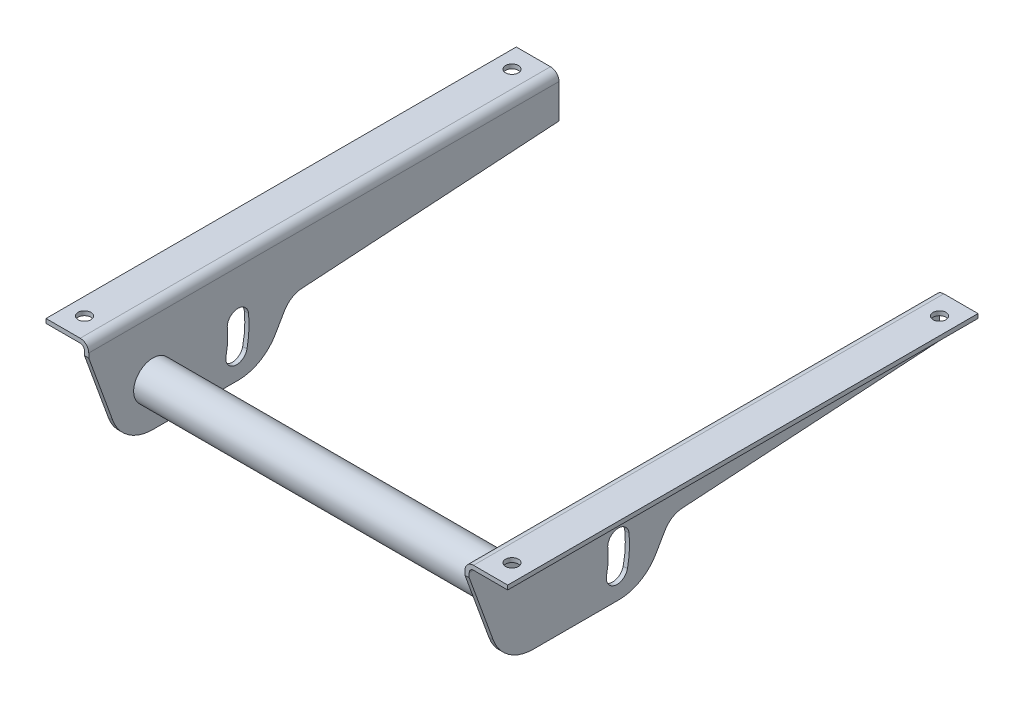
ISO-10303-21;
HEADER;
FILE_DESCRIPTION(('STEP AP214'),'2;1');
FILE_NAME('part.step','',(''),(''),'','','');
FILE_SCHEMA(('AUTOMOTIVE_DESIGN { 1 0 10303 214 1 1 1 1 }'));
ENDSEC;
DATA;
#1=APPLICATION_CONTEXT('core data for automotive mechanical design processes');
#2=APPLICATION_PROTOCOL_DEFINITION('international standard','automotive_design',2000,#1);
#3=PRODUCT_CONTEXT('',#1,'mechanical');
#4=PRODUCT('Part','Part','',(#3));
#5=PRODUCT_RELATED_PRODUCT_CATEGORY('part','',(#4));
#6=PRODUCT_DEFINITION_FORMATION('','',#4);
#7=PRODUCT_DEFINITION_CONTEXT('part definition',#1,'design');
#8=PRODUCT_DEFINITION('design','',#6,#7);
#9=PRODUCT_DEFINITION_SHAPE('','',#8);
#10=(LENGTH_UNIT() NAMED_UNIT(*) SI_UNIT(.MILLI.,.METRE.));
#11=(NAMED_UNIT(*) PLANE_ANGLE_UNIT() SI_UNIT($,.RADIAN.));
#12=(NAMED_UNIT(*) SI_UNIT($,.STERADIAN.) SOLID_ANGLE_UNIT());
#13=UNCERTAINTY_MEASURE_WITH_UNIT(LENGTH_MEASURE(1.E-05),#10,'distance_accuracy_value','');
#14=(GEOMETRIC_REPRESENTATION_CONTEXT(3) GLOBAL_UNCERTAINTY_ASSIGNED_CONTEXT((#13)) GLOBAL_UNIT_ASSIGNED_CONTEXT((#10,
#11,#12)) REPRESENTATION_CONTEXT('',''));
#15=CARTESIAN_POINT('',(0.,0.,0.));
#16=DIRECTION('',(0.,0.,1.));
#17=DIRECTION('',(1.,0.,0.));
#18=AXIS2_PLACEMENT_3D('',#15,#16,#17);
#19=CARTESIAN_POINT('',(-88.,-4.,-30.));
#20=DIRECTION('',(-1.,0.,0.));
#21=DIRECTION('',(0.,0.,1.));
#22=AXIS2_PLACEMENT_3D('',#19,#20,#21);
#23=PLANE('',#22);
#24=DIRECTION('',(0.,0.,1.));
#25=VECTOR('',#24,1.);
#26=CARTESIAN_POINT('',(-88.,-50.,-30.));
#27=LINE('',#26,#25);
#28=CARTESIAN_POINT('',(-88.,-50.,120.));
#29=VERTEX_POINT('',#28);
#30=CARTESIAN_POINT('',(-88.,-50.,160.));
#31=VERTEX_POINT('',#30);
#32=EDGE_CURVE('E574',#29,#31,#27,.T.);
#33=ORIENTED_EDGE('',*,*,#32,.F.);
#34=CARTESIAN_POINT('',(-88.,-30.,120.));
#35=DIRECTION('',(-1.,0.,0.));
#36=DIRECTION('',(0.,0.,1.));
#37=AXIS2_PLACEMENT_3D('',#34,#35,#36);
#38=CIRCLE('',#37,20.);
#39=CARTESIAN_POINT('',(-88.,-40.0000000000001,102.679491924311));
#40=VERTEX_POINT('',#39);
#41=EDGE_CURVE('E440',#29,#40,#38,.F.);
#42=ORIENTED_EDGE('',*,*,#41,.T.);
#43=DIRECTION('',(0.,0.866025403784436,-0.500000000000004));
#44=VECTOR('',#43,1.);
#45=CARTESIAN_POINT('',(-88.,44.4519052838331,53.9211616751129));
#46=LINE('',#45,#44);
#47=CARTESIAN_POINT('',(-88.,-32.6396847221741,98.4300119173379));
#48=VERTEX_POINT('',#47);
#49=EDGE_CURVE('E57',#40,#48,#46,.T.);
#50=ORIENTED_EDGE('',*,*,#49,.T.);
#51=CARTESIAN_POINT('',(-88.,-37.6396847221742,89.7697578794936));
#52=DIRECTION('',(-1.,0.,0.));
#53=DIRECTION('',(0.,0.,1.));
#54=AXIS2_PLACEMENT_3D('',#51,#52,#53);
#55=CIRCLE('',#54,9.99999999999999);
#56=CARTESIAN_POINT('',(-88.,-27.6598595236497,90.4046507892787));
#57=VERTEX_POINT('',#56);
#58=EDGE_CURVE('E600',#48,#57,#55,.T.);
#59=ORIENTED_EDGE('',*,*,#58,.T.);
#60=DIRECTION('',(0.,0.0634892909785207,-0.997982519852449));
#61=VECTOR('',#60,1.);
#62=CARTESIAN_POINT('',(-88.,-19.9355057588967,-31.0137792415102));
#63=LINE('',#62,#61);
#64=CARTESIAN_POINT('',(-88.,-20.,-30.));
#65=VERTEX_POINT('',#64);
#66=EDGE_CURVE('E423',#57,#65,#63,.T.);
#67=ORIENTED_EDGE('',*,*,#66,.T.);
#68=DIRECTION('',(0.,1.,0.));
#69=VECTOR('',#68,1.);
#70=CARTESIAN_POINT('',(-88.,-4.,-30.));
#71=LINE('',#70,#69);
#72=CARTESIAN_POINT('',(-88.,-4.,-30.));
#73=VERTEX_POINT('',#72);
#74=EDGE_CURVE('E533',#73,#65,#71,.F.);
#75=ORIENTED_EDGE('',*,*,#74,.F.);
#76=DIRECTION('',(0.,0.,1.));
#77=VECTOR('',#76,1.);
#78=CARTESIAN_POINT('',(-88.,-4.,-30.));
#79=LINE('',#78,#77);
#80=CARTESIAN_POINT('',(-88.,-4.,190.));
#81=VERTEX_POINT('',#80);
#82=EDGE_CURVE('E571',#73,#81,#79,.T.);
#83=ORIENTED_EDGE('',*,*,#82,.T.);
#84=DIRECTION('',(0.,1.,0.));
#85=VECTOR('',#84,1.);
#86=CARTESIAN_POINT('',(-88.,-4.,190.));
#87=LINE('',#86,#85);
#88=CARTESIAN_POINT('',(-88.,-6.05176541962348,190.));
#89=VERTEX_POINT('',#88);
#90=EDGE_CURVE('E505',#81,#89,#87,.F.);
#91=ORIENTED_EDGE('',*,*,#90,.T.);
#92=DIRECTION('',(0.,-0.939692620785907,-0.342020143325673));
#93=VECTOR('',#92,1.);
#94=CARTESIAN_POINT('',(-88.,-74.9466480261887,164.924313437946));
#95=LINE('',#94,#93);
#96=CARTESIAN_POINT('',(-88.,-36.8404028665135,178.793852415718));
#97=VERTEX_POINT('',#96);
#98=EDGE_CURVE('E483',#89,#97,#95,.T.);
#99=ORIENTED_EDGE('',*,*,#98,.T.);
#100=CARTESIAN_POINT('',(-88.,-30.,160.));
#101=DIRECTION('',(-1.,0.,0.));
#102=DIRECTION('',(0.,0.,1.));
#103=AXIS2_PLACEMENT_3D('',#100,#101,#102);
#104=CIRCLE('',#103,20.);
#105=EDGE_CURVE('E493',#97,#31,#104,.F.);
#106=ORIENTED_EDGE('',*,*,#105,.T.);
#107=EDGE_LOOP('',(#33,#42,#50,#59,#67,#75,#83,#91,#99,#106));
#108=FACE_BOUND('',#107,.T.);
#109=CARTESIAN_POINT('',(-88.,-30.,160.));
#110=DIRECTION('',(-1.,0.,0.));
#111=DIRECTION('',(0.,0.,1.));
#112=AXIS2_PLACEMENT_3D('',#109,#110,#111);
#113=CIRCLE('',#112,45.);
#114=CARTESIAN_POINT('',(-88.,-25.2962191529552,115.246514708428));
#115=VERTEX_POINT('',#114);
#116=CARTESIAN_POINT('',(-88.,-39.3560260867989,115.983357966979));
#117=VERTEX_POINT('',#116);
#118=EDGE_CURVE('E581',#115,#117,#113,.T.);
#119=ORIENTED_EDGE('',*,*,#118,.T.);
#120=CARTESIAN_POINT('',(-88.,-38.3164676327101,120.874095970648));
#121=DIRECTION('',(-1.,0.,0.));
#122=DIRECTION('',(0.,0.,1.));
#123=AXIS2_PLACEMENT_3D('',#120,#121,#122);
#124=CIRCLE('',#123,4.99999999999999);
#125=CARTESIAN_POINT('',(-88.,-37.2769091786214,125.764833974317));
#126=VERTEX_POINT('',#125);
#127=EDGE_CURVE('E593',#117,#126,#124,.T.);
#128=ORIENTED_EDGE('',*,*,#127,.T.);
#129=CARTESIAN_POINT('',(-88.,-30.,160.));
#130=DIRECTION('',(-1.,0.,0.));
#131=DIRECTION('',(0.,0.,1.));
#132=AXIS2_PLACEMENT_3D('',#129,#130,#131);
#133=CIRCLE('',#132,35.);
#134=CARTESIAN_POINT('',(-88.,-26.3415037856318,125.19173366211));
#135=VERTEX_POINT('',#134);
#136=EDGE_CURVE('E589',#126,#135,#133,.F.);
#137=ORIENTED_EDGE('',*,*,#136,.T.);
#138=CARTESIAN_POINT('',(-88.,-25.8188614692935,120.219124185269));
#139=DIRECTION('',(-1.,0.,0.));
#140=DIRECTION('',(0.,0.,1.));
#141=AXIS2_PLACEMENT_3D('',#138,#139,#140);
#142=CIRCLE('',#141,4.99999999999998);
#143=EDGE_CURVE('E585',#135,#115,#142,.T.);
#144=ORIENTED_EDGE('',*,*,#143,.T.);
#145=EDGE_LOOP('',(#119,#128,#137,#144));
#146=FACE_BOUND('',#145,.T.);
#147=CARTESIAN_POINT('',(-88.,-30.,160.));
#148=DIRECTION('',(-1.,0.,0.));
#149=DIRECTION('',(0.,0.,1.));
#150=AXIS2_PLACEMENT_3D('',#147,#148,#149);
#151=CIRCLE('',#150,9.00000000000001);
#152=CARTESIAN_POINT('',(-88.,-30.,169.));
#153=VERTEX_POINT('',#152);
#154=EDGE_CURVE('E11',#153,#153,#151,.F.);
#155=ORIENTED_EDGE('',*,*,#154,.F.);
#156=EDGE_LOOP('',(#155));
#157=FACE_BOUND('',#156,.T.);
#158=ADVANCED_FACE('F47',(#108,#146,#157),#23,.F.);
#159=CARTESIAN_POINT('',(-88.,-50.,-30.));
#160=DIRECTION('',(0.,1.,0.));
#161=DIRECTION('',(0.,0.,1.));
#162=AXIS2_PLACEMENT_3D('',#159,#160,#161);
#163=PLANE('',#162);
#164=DIRECTION('',(1.,0.,0.));
#165=VECTOR('',#164,1.);
#166=CARTESIAN_POINT('',(-108.,-50.,120.));
#167=LINE('',#166,#165);
#168=CARTESIAN_POINT('',(-90.,-50.,120.));
#169=VERTEX_POINT('',#168);
#170=EDGE_CURVE('E419',#169,#29,#167,.T.);
#171=ORIENTED_EDGE('',*,*,#170,.T.);
#172=ORIENTED_EDGE('',*,*,#32,.T.);
#173=DIRECTION('',(1.,0.,0.));
#174=VECTOR('',#173,1.);
#175=CARTESIAN_POINT('',(-108.,-50.,160.));
#176=LINE('',#175,#174);
#177=CARTESIAN_POINT('',(-90.,-50.,160.));
#178=VERTEX_POINT('',#177);
#179=EDGE_CURVE('E479',#178,#31,#176,.T.);
#180=ORIENTED_EDGE('',*,*,#179,.F.);
#181=DIRECTION('',(0.,0.,1.));
#182=VECTOR('',#181,1.);
#183=CARTESIAN_POINT('',(-90.,-50.,-30.));
#184=LINE('',#183,#182);
#185=EDGE_CURVE('E554',#169,#178,#184,.T.);
#186=ORIENTED_EDGE('',*,*,#185,.F.);
#187=EDGE_LOOP('',(#171,#172,#180,#186));
#188=FACE_BOUND('',#187,.T.);
#189=ADVANCED_FACE('F625',(#188),#163,.F.);
#190=CARTESIAN_POINT('',(-90.,-4.,-30.));
#191=DIRECTION('',(-1.,0.,0.));
#192=DIRECTION('',(0.,0.,1.));
#193=AXIS2_PLACEMENT_3D('',#190,#191,#192);
#194=PLANE('',#193);
#195=CARTESIAN_POINT('',(-90.,-30.,120.));
#196=DIRECTION('',(-1.,0.,0.));
#197=DIRECTION('',(0.,0.,1.));
#198=AXIS2_PLACEMENT_3D('',#195,#196,#197);
#199=CIRCLE('',#198,20.);
#200=CARTESIAN_POINT('',(-90.,-40.0000000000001,102.679491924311));
#201=VERTEX_POINT('',#200);
#202=EDGE_CURVE('E444',#169,#201,#199,.F.);
#203=ORIENTED_EDGE('',*,*,#202,.F.);
#204=ORIENTED_EDGE('',*,*,#185,.T.);
#205=CARTESIAN_POINT('',(-90.,-30.,160.));
#206=DIRECTION('',(-1.,0.,0.));
#207=DIRECTION('',(0.,0.,1.));
#208=AXIS2_PLACEMENT_3D('',#205,#206,#207);
#209=CIRCLE('',#208,20.);
#210=CARTESIAN_POINT('',(-90.,-36.8404028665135,178.793852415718));
#211=VERTEX_POINT('',#210);
#212=EDGE_CURVE('E497',#211,#178,#209,.F.);
#213=ORIENTED_EDGE('',*,*,#212,.F.);
#214=DIRECTION('',(0.,-0.939692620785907,-0.342020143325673));
#215=VECTOR('',#214,1.);
#216=CARTESIAN_POINT('',(-90.,-74.9466480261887,164.924313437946));
#217=LINE('',#216,#215);
#218=CARTESIAN_POINT('',(-90.,-6.05176541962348,190.));
#219=VERTEX_POINT('',#218);
#220=EDGE_CURVE('E490',#219,#211,#217,.T.);
#221=ORIENTED_EDGE('',*,*,#220,.F.);
#222=DIRECTION('',(0.,-1.,0.));
#223=VECTOR('',#222,1.);
#224=CARTESIAN_POINT('',(-90.,-4.,190.));
#225=LINE('',#224,#223);
#226=CARTESIAN_POINT('',(-90.,-4.,190.));
#227=VERTEX_POINT('',#226);
#228=EDGE_CURVE('E501',#227,#219,#225,.T.);
#229=ORIENTED_EDGE('',*,*,#228,.F.);
#230=DIRECTION('',(0.,0.,1.));
#231=VECTOR('',#230,1.);
#232=CARTESIAN_POINT('',(-90.,-4.,-30.));
#233=LINE('',#232,#231);
#234=CARTESIAN_POINT('',(-90.,-4.,-30.));
#235=VERTEX_POINT('',#234);
#236=EDGE_CURVE('E555',#235,#227,#233,.T.);
#237=ORIENTED_EDGE('',*,*,#236,.F.);
#238=DIRECTION('',(0.,-1.,0.));
#239=VECTOR('',#238,1.);
#240=CARTESIAN_POINT('',(-90.,-4.,-30.));
#241=LINE('',#240,#239);
#242=CARTESIAN_POINT('',(-90.,-20.,-30.));
#243=VERTEX_POINT('',#242);
#244=EDGE_CURVE('E529',#235,#243,#241,.T.);
#245=ORIENTED_EDGE('',*,*,#244,.T.);
#246=DIRECTION('',(0.,0.0634892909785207,-0.997982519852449));
#247=VECTOR('',#246,1.);
#248=CARTESIAN_POINT('',(-90.,-19.9355057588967,-31.0137792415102));
#249=LINE('',#248,#247);
#250=CARTESIAN_POINT('',(-90.,-27.6598595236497,90.4046507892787));
#251=VERTEX_POINT('',#250);
#252=EDGE_CURVE('E64',#251,#243,#249,.T.);
#253=ORIENTED_EDGE('',*,*,#252,.F.);
#254=CARTESIAN_POINT('',(-90.,-37.6396847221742,89.7697578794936));
#255=DIRECTION('',(-1.,0.,0.));
#256=DIRECTION('',(0.,0.,1.));
#257=AXIS2_PLACEMENT_3D('',#254,#255,#256);
#258=CIRCLE('',#257,9.99999999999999);
#259=CARTESIAN_POINT('',(-90.,-32.6396847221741,98.4300119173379));
#260=VERTEX_POINT('',#259);
#261=EDGE_CURVE('E447',#260,#251,#258,.T.);
#262=ORIENTED_EDGE('',*,*,#261,.F.);
#263=DIRECTION('',(0.,0.866025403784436,-0.500000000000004));
#264=VECTOR('',#263,1.);
#265=CARTESIAN_POINT('',(-90.,44.4519052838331,53.9211616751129));
#266=LINE('',#265,#264);
#267=EDGE_CURVE('E450',#201,#260,#266,.T.);
#268=ORIENTED_EDGE('',*,*,#267,.F.);
#269=EDGE_LOOP('',(#203,#204,#213,#221,#229,#237,#245,#253,#262,#268));
#270=FACE_BOUND('',#269,.T.);
#271=CARTESIAN_POINT('',(-90.,-38.3164676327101,120.874095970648));
#272=DIRECTION('',(-1.,0.,0.));
#273=DIRECTION('',(0.,0.,1.));
#274=AXIS2_PLACEMENT_3D('',#271,#272,#273);
#275=CIRCLE('',#274,4.99999999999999);
#276=CARTESIAN_POINT('',(-90.,-39.3560260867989,115.983357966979));
#277=VERTEX_POINT('',#276);
#278=CARTESIAN_POINT('',(-90.,-37.2769091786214,125.764833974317));
#279=VERTEX_POINT('',#278);
#280=EDGE_CURVE('E475',#277,#279,#275,.T.);
#281=ORIENTED_EDGE('',*,*,#280,.F.);
#282=CARTESIAN_POINT('',(-90.,-30.,160.));
#283=DIRECTION('',(-1.,0.,0.));
#284=DIRECTION('',(0.,0.,1.));
#285=AXIS2_PLACEMENT_3D('',#282,#283,#284);
#286=CIRCLE('',#285,45.);
#287=CARTESIAN_POINT('',(-90.,-25.2962191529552,115.246514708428));
#288=VERTEX_POINT('',#287);
#289=EDGE_CURVE('E458',#288,#277,#286,.T.);
#290=ORIENTED_EDGE('',*,*,#289,.F.);
#291=CARTESIAN_POINT('',(-90.,-25.8188614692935,120.219124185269));
#292=DIRECTION('',(-1.,0.,0.));
#293=DIRECTION('',(0.,0.,1.));
#294=AXIS2_PLACEMENT_3D('',#291,#292,#293);
#295=CIRCLE('',#294,4.99999999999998);
#296=CARTESIAN_POINT('',(-90.,-26.3415037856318,125.19173366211));
#297=VERTEX_POINT('',#296);
#298=EDGE_CURVE('E469',#297,#288,#295,.T.);
#299=ORIENTED_EDGE('',*,*,#298,.F.);
#300=CARTESIAN_POINT('',(-90.,-30.,160.));
#301=DIRECTION('',(-1.,0.,0.));
#302=DIRECTION('',(0.,0.,1.));
#303=AXIS2_PLACEMENT_3D('',#300,#301,#302);
#304=CIRCLE('',#303,35.);
#305=EDGE_CURVE('E472',#279,#297,#304,.F.);
#306=ORIENTED_EDGE('',*,*,#305,.F.);
#307=EDGE_LOOP('',(#281,#290,#299,#306));
#308=FACE_BOUND('',#307,.T.);
#309=ADVANCED_FACE('F49',(#270,#308),#194,.T.);
#310=CARTESIAN_POINT('',(-92.,-4.,-30.));
#311=DIRECTION('',(0.,0.,1.));
#312=DIRECTION('',(1.,0.,0.));
#313=AXIS2_PLACEMENT_3D('',#310,#311,#312);
#314=CYLINDRICAL_SURFACE('',#313,2.);
#315=ORIENTED_EDGE('',*,*,#236,.T.);
#316=CARTESIAN_POINT('',(-92.,-4.,190.));
#317=DIRECTION('',(0.,0.,-1.));
#318=DIRECTION('',(-1.,0.,0.));
#319=AXIS2_PLACEMENT_3D('',#316,#317,#318);
#320=CIRCLE('',#319,2.);
#321=CARTESIAN_POINT('',(-92.,-2.,190.));
#322=VERTEX_POINT('',#321);
#323=EDGE_CURVE('E525',#322,#227,#320,.T.);
#324=ORIENTED_EDGE('',*,*,#323,.F.);
#325=DIRECTION('',(0.,0.,1.));
#326=VECTOR('',#325,1.);
#327=CARTESIAN_POINT('',(-92.,-2.,-30.));
#328=LINE('',#327,#326);
#329=CARTESIAN_POINT('',(-92.,-2.,-30.));
#330=VERTEX_POINT('',#329);
#331=EDGE_CURVE('E559',#330,#322,#328,.T.);
#332=ORIENTED_EDGE('',*,*,#331,.F.);
#333=CARTESIAN_POINT('',(-92.,-4.,-30.));
#334=DIRECTION('',(0.,0.,-1.));
#335=DIRECTION('',(-1.,0.,0.));
#336=AXIS2_PLACEMENT_3D('',#333,#334,#335);
#337=CIRCLE('',#336,2.);
#338=EDGE_CURVE('E550',#330,#235,#337,.T.);
#339=ORIENTED_EDGE('',*,*,#338,.T.);
#340=EDGE_LOOP('',(#315,#324,#332,#339));
#341=FACE_BOUND('',#340,.T.);
#342=ADVANCED_FACE('F645',(#341),#314,.F.);
#343=CARTESIAN_POINT('',(-108.,-2.,-30.));
#344=DIRECTION('',(0.,-1.,0.));
#345=DIRECTION('',(1.,0.,0.));
#346=AXIS2_PLACEMENT_3D('',#343,#344,#345);
#347=PLANE('',#346);
#348=CARTESIAN_POINT('',(-100.,-2.,-20.));
#349=DIRECTION('',(0.,-1.,0.));
#350=DIRECTION('',(1.,0.,0.));
#351=AXIS2_PLACEMENT_3D('',#348,#349,#350);
#352=CIRCLE('',#351,3.00000000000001);
#353=CARTESIAN_POINT('',(-97.,-2.,-20.));
#354=VERTEX_POINT('',#353);
#355=EDGE_CURVE('E406',#354,#354,#352,.T.);
#356=ORIENTED_EDGE('',*,*,#355,.F.);
#357=EDGE_LOOP('',(#356));
#358=FACE_BOUND('',#357,.T.);
#359=CARTESIAN_POINT('',(-100.,-2.,180.));
#360=DIRECTION('',(0.,-1.,0.));
#361=DIRECTION('',(1.,0.,0.));
#362=AXIS2_PLACEMENT_3D('',#359,#360,#361);
#363=CIRCLE('',#362,3.00000000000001);
#364=CARTESIAN_POINT('',(-97.,-2.,180.));
#365=VERTEX_POINT('',#364);
#366=EDGE_CURVE('E414',#365,#365,#363,.T.);
#367=ORIENTED_EDGE('',*,*,#366,.F.);
#368=EDGE_LOOP('',(#367));
#369=FACE_BOUND('',#368,.T.);
#370=ORIENTED_EDGE('',*,*,#331,.T.);
#371=DIRECTION('',(1.,0.,0.));
#372=VECTOR('',#371,1.);
#373=CARTESIAN_POINT('',(-108.,-2.,190.));
#374=LINE('',#373,#372);
#375=CARTESIAN_POINT('',(-108.,-2.,190.));
#376=VERTEX_POINT('',#375);
#377=EDGE_CURVE('E521',#376,#322,#374,.T.);
#378=ORIENTED_EDGE('',*,*,#377,.F.);
#379=DIRECTION('',(0.,0.,1.));
#380=VECTOR('',#379,1.);
#381=CARTESIAN_POINT('',(-108.,-2.,-30.));
#382=LINE('',#381,#380);
#383=CARTESIAN_POINT('',(-108.,-2.,-30.));
#384=VERTEX_POINT('',#383);
#385=EDGE_CURVE('E562',#384,#376,#382,.T.);
#386=ORIENTED_EDGE('',*,*,#385,.F.);
#387=DIRECTION('',(1.,0.,0.));
#388=VECTOR('',#387,1.);
#389=CARTESIAN_POINT('',(-108.,-2.,-30.));
#390=LINE('',#389,#388);
#391=EDGE_CURVE('E546',#384,#330,#390,.T.);
#392=ORIENTED_EDGE('',*,*,#391,.T.);
#393=EDGE_LOOP('',(#370,#378,#386,#392));
#394=FACE_BOUND('',#393,.T.);
#395=ADVANCED_FACE('F648',(#358,#369,#394),#347,.T.);
#396=CARTESIAN_POINT('',(-108.,-2.,-30.));
#397=DIRECTION('',(1.,0.,0.));
#398=DIRECTION('',(0.,0.,-1.));
#399=AXIS2_PLACEMENT_3D('',#396,#397,#398);
#400=PLANE('',#399);
#401=ORIENTED_EDGE('',*,*,#385,.T.);
#402=DIRECTION('',(0.,1.,0.));
#403=VECTOR('',#402,1.);
#404=CARTESIAN_POINT('',(-108.,-2.,190.));
#405=LINE('',#404,#403);
#406=CARTESIAN_POINT('',(-108.,0.,190.));
#407=VERTEX_POINT('',#406);
#408=EDGE_CURVE('E517',#376,#407,#405,.T.);
#409=ORIENTED_EDGE('',*,*,#408,.T.);
#410=DIRECTION('',(0.,0.,1.));
#411=VECTOR('',#410,1.);
#412=CARTESIAN_POINT('',(-108.,0.,-30.));
#413=LINE('',#412,#411);
#414=CARTESIAN_POINT('',(-108.,0.,-30.));
#415=VERTEX_POINT('',#414);
#416=EDGE_CURVE('E565',#415,#407,#413,.T.);
#417=ORIENTED_EDGE('',*,*,#416,.F.);
#418=DIRECTION('',(0.,1.,0.));
#419=VECTOR('',#418,1.);
#420=CARTESIAN_POINT('',(-108.,-2.,-30.));
#421=LINE('',#420,#419);
#422=EDGE_CURVE('E543',#384,#415,#421,.T.);
#423=ORIENTED_EDGE('',*,*,#422,.F.);
#424=EDGE_LOOP('',(#401,#409,#417,#423));
#425=FACE_BOUND('',#424,.T.);
#426=ADVANCED_FACE('F654',(#425),#400,.F.);
#427=CARTESIAN_POINT('',(-108.,0.,-30.));
#428=DIRECTION('',(0.,-1.,0.));
#429=DIRECTION('',(1.,0.,0.));
#430=AXIS2_PLACEMENT_3D('',#427,#428,#429);
#431=PLANE('',#430);
#432=CARTESIAN_POINT('',(-100.,0.,-20.));
#433=DIRECTION('',(0.,1.,0.));
#434=DIRECTION('',(0.,0.,1.));
#435=AXIS2_PLACEMENT_3D('',#432,#433,#434);
#436=CIRCLE('',#435,3.00000000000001);
#437=CARTESIAN_POINT('',(-100.,0.,-17.));
#438=VERTEX_POINT('',#437);
#439=EDGE_CURVE('E402',#438,#438,#436,.T.);
#440=ORIENTED_EDGE('',*,*,#439,.F.);
#441=EDGE_LOOP('',(#440));
#442=FACE_BOUND('',#441,.T.);
#443=CARTESIAN_POINT('',(-100.,0.,180.));
#444=DIRECTION('',(0.,1.,0.));
#445=DIRECTION('',(0.,0.,1.));
#446=AXIS2_PLACEMENT_3D('',#443,#444,#445);
#447=CIRCLE('',#446,3.00000000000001);
#448=CARTESIAN_POINT('',(-100.,0.,183.));
#449=VERTEX_POINT('',#448);
#450=EDGE_CURVE('E410',#449,#449,#447,.T.);
#451=ORIENTED_EDGE('',*,*,#450,.F.);
#452=EDGE_LOOP('',(#451));
#453=FACE_BOUND('',#452,.T.);
#454=ORIENTED_EDGE('',*,*,#416,.T.);
#455=DIRECTION('',(1.,0.,0.));
#456=VECTOR('',#455,1.);
#457=CARTESIAN_POINT('',(-108.,0.,190.));
#458=LINE('',#457,#456);
#459=CARTESIAN_POINT('',(-92.,0.,190.));
#460=VERTEX_POINT('',#459);
#461=EDGE_CURVE('E513',#407,#460,#458,.T.);
#462=ORIENTED_EDGE('',*,*,#461,.T.);
#463=DIRECTION('',(0.,0.,1.));
#464=VECTOR('',#463,1.);
#465=CARTESIAN_POINT('',(-92.,0.,-30.));
#466=LINE('',#465,#464);
#467=CARTESIAN_POINT('',(-92.,0.,-30.));
#468=VERTEX_POINT('',#467);
#469=EDGE_CURVE('E568',#468,#460,#466,.T.);
#470=ORIENTED_EDGE('',*,*,#469,.F.);
#471=DIRECTION('',(1.,0.,0.));
#472=VECTOR('',#471,1.);
#473=CARTESIAN_POINT('',(-108.,0.,-30.));
#474=LINE('',#473,#472);
#475=EDGE_CURVE('E540',#415,#468,#474,.T.);
#476=ORIENTED_EDGE('',*,*,#475,.F.);
#477=EDGE_LOOP('',(#454,#462,#470,#476));
#478=FACE_BOUND('',#477,.T.);
#479=ADVANCED_FACE('F658',(#442,#453,#478),#431,.F.);
#480=CARTESIAN_POINT('',(-92.,-4.,-30.));
#481=DIRECTION('',(0.,0.,1.));
#482=DIRECTION('',(1.,0.,0.));
#483=AXIS2_PLACEMENT_3D('',#480,#481,#482);
#484=CYLINDRICAL_SURFACE('',#483,4.);
#485=ORIENTED_EDGE('',*,*,#469,.T.);
#486=CARTESIAN_POINT('',(-92.,-4.,190.));
#487=DIRECTION('',(0.,0.,1.));
#488=DIRECTION('',(1.,0.,0.));
#489=AXIS2_PLACEMENT_3D('',#486,#487,#488);
#490=CIRCLE('',#489,4.);
#491=EDGE_CURVE('E509',#460,#81,#490,.F.);
#492=ORIENTED_EDGE('',*,*,#491,.T.);
#493=ORIENTED_EDGE('',*,*,#82,.F.);
#494=CARTESIAN_POINT('',(-92.,-4.,-30.));
#495=DIRECTION('',(0.,0.,1.));
#496=DIRECTION('',(1.,0.,0.));
#497=AXIS2_PLACEMENT_3D('',#494,#495,#496);
#498=CIRCLE('',#497,4.);
#499=EDGE_CURVE('E537',#468,#73,#498,.F.);
#500=ORIENTED_EDGE('',*,*,#499,.F.);
#501=EDGE_LOOP('',(#485,#492,#493,#500));
#502=FACE_BOUND('',#501,.T.);
#503=ADVANCED_FACE('F662',(#502),#484,.T.);
#504=CARTESIAN_POINT('',(-92.,-4.,-30.));
#505=DIRECTION('',(0.,0.,1.));
#506=DIRECTION('',(1.,0.,0.));
#507=AXIS2_PLACEMENT_3D('',#504,#505,#506);
#508=PLANE('',#507);
#509=ORIENTED_EDGE('',*,*,#74,.T.);
#510=DIRECTION('',(-1.,0.,0.));
#511=VECTOR('',#510,1.);
#512=CARTESIAN_POINT('',(-92.,-20.,-30.));
#513=LINE('',#512,#511);
#514=EDGE_CURVE('E597',#65,#243,#513,.T.);
#515=ORIENTED_EDGE('',*,*,#514,.T.);
#516=ORIENTED_EDGE('',*,*,#244,.F.);
#517=ORIENTED_EDGE('',*,*,#338,.F.);
#518=ORIENTED_EDGE('',*,*,#391,.F.);
#519=ORIENTED_EDGE('',*,*,#422,.T.);
#520=ORIENTED_EDGE('',*,*,#475,.T.);
#521=ORIENTED_EDGE('',*,*,#499,.T.);
#522=EDGE_LOOP('',(#509,#515,#516,#517,#518,#519,#520,#521));
#523=FACE_BOUND('',#522,.T.);
#524=ADVANCED_FACE('F643',(#523),#508,.F.);
#525=CARTESIAN_POINT('',(-92.,-4.,190.));
#526=DIRECTION('',(0.,0.,1.));
#527=DIRECTION('',(1.,0.,0.));
#528=AXIS2_PLACEMENT_3D('',#525,#526,#527);
#529=PLANE('',#528);
#530=DIRECTION('',(-1.,0.,0.));
#531=VECTOR('',#530,1.);
#532=CARTESIAN_POINT('',(-92.,-6.05176541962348,190.));
#533=LINE('',#532,#531);
#534=EDGE_CURVE('E558',#89,#219,#533,.T.);
#535=ORIENTED_EDGE('',*,*,#534,.F.);
#536=ORIENTED_EDGE('',*,*,#90,.F.);
#537=ORIENTED_EDGE('',*,*,#491,.F.);
#538=ORIENTED_EDGE('',*,*,#461,.F.);
#539=ORIENTED_EDGE('',*,*,#408,.F.);
#540=ORIENTED_EDGE('',*,*,#377,.T.);
#541=ORIENTED_EDGE('',*,*,#323,.T.);
#542=ORIENTED_EDGE('',*,*,#228,.T.);
#543=EDGE_LOOP('',(#535,#536,#537,#538,#539,#540,#541,#542));
#544=FACE_BOUND('',#543,.T.);
#545=ADVANCED_FACE('F635',(#544),#529,.T.);
#546=CARTESIAN_POINT('',(-108.,-30.,160.));
#547=DIRECTION('',(1.,0.,0.));
#548=DIRECTION('',(0.,0.,-1.));
#549=AXIS2_PLACEMENT_3D('',#546,#547,#548);
#550=CYLINDRICAL_SURFACE('',#549,20.);
#551=ORIENTED_EDGE('',*,*,#212,.T.);
#552=ORIENTED_EDGE('',*,*,#179,.T.);
#553=ORIENTED_EDGE('',*,*,#105,.F.);
#554=DIRECTION('',(1.,0.,0.));
#555=VECTOR('',#554,1.);
#556=CARTESIAN_POINT('',(-108.,-36.8404028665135,178.793852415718));
#557=LINE('',#556,#555);
#558=EDGE_CURVE('E478',#211,#97,#557,.T.);
#559=ORIENTED_EDGE('',*,*,#558,.F.);
#560=EDGE_LOOP('',(#551,#552,#553,#559));
#561=FACE_BOUND('',#560,.T.);
#562=ADVANCED_FACE('F627',(#561),#550,.T.);
#563=CARTESIAN_POINT('',(-108.,-36.8404028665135,178.793852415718));
#564=DIRECTION('',(0.,0.342020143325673,-0.939692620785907));
#565=DIRECTION('',(0.,0.939692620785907,0.342020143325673));
#566=AXIS2_PLACEMENT_3D('',#563,#564,#565);
#567=PLANE('',#566);
#568=ORIENTED_EDGE('',*,*,#220,.T.);
#569=ORIENTED_EDGE('',*,*,#558,.T.);
#570=ORIENTED_EDGE('',*,*,#98,.F.);
#571=ORIENTED_EDGE('',*,*,#534,.T.);
#572=EDGE_LOOP('',(#568,#569,#570,#571));
#573=FACE_BOUND('',#572,.T.);
#574=ADVANCED_FACE('F632',(#573),#567,.F.);
#575=CARTESIAN_POINT('',(-108.,-38.3164676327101,120.874095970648));
#576=DIRECTION('',(1.,0.,0.));
#577=DIRECTION('',(0.,0.,-1.));
#578=AXIS2_PLACEMENT_3D('',#575,#576,#577);
#579=CYLINDRICAL_SURFACE('',#578,4.99999999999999);
#580=ORIENTED_EDGE('',*,*,#280,.T.);
#581=DIRECTION('',(1.,0.,0.));
#582=VECTOR('',#581,1.);
#583=CARTESIAN_POINT('',(-108.,-37.2769091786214,125.764833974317));
#584=LINE('',#583,#582);
#585=EDGE_CURVE('E454',#279,#126,#584,.T.);
#586=ORIENTED_EDGE('',*,*,#585,.T.);
#587=ORIENTED_EDGE('',*,*,#127,.F.);
#588=DIRECTION('',(1.,0.,0.));
#589=VECTOR('',#588,1.);
#590=CARTESIAN_POINT('',(-108.,-39.3560260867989,115.983357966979));
#591=LINE('',#590,#589);
#592=EDGE_CURVE('E453',#277,#117,#591,.T.);
#593=ORIENTED_EDGE('',*,*,#592,.F.);
#594=EDGE_LOOP('',(#580,#586,#587,#593));
#595=FACE_BOUND('',#594,.T.);
#596=ADVANCED_FACE('F937',(#595),#579,.F.);
#597=CARTESIAN_POINT('',(-108.,-30.,160.));
#598=DIRECTION('',(1.,0.,0.));
#599=DIRECTION('',(0.,0.,-1.));
#600=AXIS2_PLACEMENT_3D('',#597,#598,#599);
#601=CYLINDRICAL_SURFACE('',#600,35.);
#602=ORIENTED_EDGE('',*,*,#305,.T.);
#603=DIRECTION('',(1.,0.,0.));
#604=VECTOR('',#603,1.);
#605=CARTESIAN_POINT('',(-108.,-26.3415037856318,125.19173366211));
#606=LINE('',#605,#604);
#607=EDGE_CURVE('E459',#297,#135,#606,.T.);
#608=ORIENTED_EDGE('',*,*,#607,.T.);
#609=ORIENTED_EDGE('',*,*,#136,.F.);
#610=ORIENTED_EDGE('',*,*,#585,.F.);
#611=EDGE_LOOP('',(#602,#608,#609,#610));
#612=FACE_BOUND('',#611,.T.);
#613=ADVANCED_FACE('F940',(#612),#601,.T.);
#614=CARTESIAN_POINT('',(-108.,-25.8188614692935,120.219124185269));
#615=DIRECTION('',(1.,0.,0.));
#616=DIRECTION('',(0.,0.,-1.));
#617=AXIS2_PLACEMENT_3D('',#614,#615,#616);
#618=CYLINDRICAL_SURFACE('',#617,4.99999999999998);
#619=ORIENTED_EDGE('',*,*,#298,.T.);
#620=DIRECTION('',(1.,0.,0.));
#621=VECTOR('',#620,1.);
#622=CARTESIAN_POINT('',(-108.,-25.2962191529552,115.246514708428));
#623=LINE('',#622,#621);
#624=EDGE_CURVE('E72',#288,#115,#623,.T.);
#625=ORIENTED_EDGE('',*,*,#624,.T.);
#626=ORIENTED_EDGE('',*,*,#143,.F.);
#627=ORIENTED_EDGE('',*,*,#607,.F.);
#628=EDGE_LOOP('',(#619,#625,#626,#627));
#629=FACE_BOUND('',#628,.T.);
#630=ADVANCED_FACE('F944',(#629),#618,.F.);
#631=CARTESIAN_POINT('',(-108.,-30.,160.));
#632=DIRECTION('',(1.,0.,0.));
#633=DIRECTION('',(0.,0.,-1.));
#634=AXIS2_PLACEMENT_3D('',#631,#632,#633);
#635=CYLINDRICAL_SURFACE('',#634,45.);
#636=ORIENTED_EDGE('',*,*,#289,.T.);
#637=ORIENTED_EDGE('',*,*,#592,.T.);
#638=ORIENTED_EDGE('',*,*,#118,.F.);
#639=ORIENTED_EDGE('',*,*,#624,.F.);
#640=EDGE_LOOP('',(#636,#637,#638,#639));
#641=FACE_BOUND('',#640,.T.);
#642=ADVANCED_FACE('F674',(#641),#635,.F.);
#643=CARTESIAN_POINT('',(-108.,-40.0000000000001,102.679491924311));
#644=DIRECTION('',(0.,0.500000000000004,0.866025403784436));
#645=DIRECTION('',(0.,-0.866025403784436,0.500000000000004));
#646=AXIS2_PLACEMENT_3D('',#643,#644,#645);
#647=PLANE('',#646);
#648=ORIENTED_EDGE('',*,*,#267,.T.);
#649=DIRECTION('',(1.,0.,0.));
#650=VECTOR('',#649,1.);
#651=CARTESIAN_POINT('',(-108.,-32.6396847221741,98.4300119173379));
#652=LINE('',#651,#650);
#653=EDGE_CURVE('E428',#260,#48,#652,.T.);
#654=ORIENTED_EDGE('',*,*,#653,.T.);
#655=ORIENTED_EDGE('',*,*,#49,.F.);
#656=DIRECTION('',(1.,0.,0.));
#657=VECTOR('',#656,1.);
#658=CARTESIAN_POINT('',(-108.,-40.0000000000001,102.679491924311));
#659=LINE('',#658,#657);
#660=EDGE_CURVE('E424',#201,#40,#659,.T.);
#661=ORIENTED_EDGE('',*,*,#660,.F.);
#662=EDGE_LOOP('',(#648,#654,#655,#661));
#663=FACE_BOUND('',#662,.T.);
#664=ADVANCED_FACE('F612',(#663),#647,.F.);
#665=CARTESIAN_POINT('',(-108.,-37.6396847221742,89.7697578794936));
#666=DIRECTION('',(1.,0.,0.));
#667=DIRECTION('',(0.,0.,-1.));
#668=AXIS2_PLACEMENT_3D('',#665,#666,#667);
#669=CYLINDRICAL_SURFACE('',#668,9.99999999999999);
#670=ORIENTED_EDGE('',*,*,#261,.T.);
#671=DIRECTION('',(1.,0.,0.));
#672=VECTOR('',#671,1.);
#673=CARTESIAN_POINT('',(-108.,-27.6598595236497,90.4046507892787));
#674=LINE('',#673,#672);
#675=EDGE_CURVE('E418',#251,#57,#674,.T.);
#676=ORIENTED_EDGE('',*,*,#675,.T.);
#677=ORIENTED_EDGE('',*,*,#58,.F.);
#678=ORIENTED_EDGE('',*,*,#653,.F.);
#679=EDGE_LOOP('',(#670,#676,#677,#678));
#680=FACE_BOUND('',#679,.T.);
#681=ADVANCED_FACE('F666',(#680),#669,.F.);
#682=CARTESIAN_POINT('',(-108.,-30.,120.));
#683=DIRECTION('',(1.,0.,0.));
#684=DIRECTION('',(0.,0.,-1.));
#685=AXIS2_PLACEMENT_3D('',#682,#683,#684);
#686=CYLINDRICAL_SURFACE('',#685,20.);
#687=ORIENTED_EDGE('',*,*,#202,.T.);
#688=ORIENTED_EDGE('',*,*,#660,.T.);
#689=ORIENTED_EDGE('',*,*,#41,.F.);
#690=ORIENTED_EDGE('',*,*,#170,.F.);
#691=EDGE_LOOP('',(#687,#688,#689,#690));
#692=FACE_BOUND('',#691,.T.);
#693=ADVANCED_FACE('F616',(#692),#686,.T.);
#694=CARTESIAN_POINT('',(-108.,-20.,-30.));
#695=DIRECTION('',(0.,0.997982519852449,0.0634892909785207));
#696=DIRECTION('',(0.,-0.0634892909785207,0.997982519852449));
#697=AXIS2_PLACEMENT_3D('',#694,#695,#696);
#698=PLANE('',#697);
#699=ORIENTED_EDGE('',*,*,#252,.T.);
#700=ORIENTED_EDGE('',*,*,#514,.F.);
#701=ORIENTED_EDGE('',*,*,#66,.F.);
#702=ORIENTED_EDGE('',*,*,#675,.F.);
#703=EDGE_LOOP('',(#699,#700,#701,#702));
#704=FACE_BOUND('',#703,.T.);
#705=ADVANCED_FACE('F664',(#704),#698,.F.);
#706=CARTESIAN_POINT('',(-100.,-50.,180.));
#707=DIRECTION('',(0.,1.,0.));
#708=DIRECTION('',(0.,0.,1.));
#709=AXIS2_PLACEMENT_3D('',#706,#707,#708);
#710=CYLINDRICAL_SURFACE('',#709,3.00000000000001);
#711=ORIENTED_EDGE('',*,*,#366,.T.);
#712=EDGE_LOOP('',(#711));
#713=FACE_BOUND('',#712,.T.);
#714=ORIENTED_EDGE('',*,*,#450,.T.);
#715=EDGE_LOOP('',(#714));
#716=FACE_BOUND('',#715,.T.);
#717=ADVANCED_FACE('F903',(#713,#716),#710,.F.);
#718=CARTESIAN_POINT('',(-100.,-50.,-20.));
#719=DIRECTION('',(0.,1.,0.));
#720=DIRECTION('',(0.,0.,1.));
#721=AXIS2_PLACEMENT_3D('',#718,#719,#720);
#722=CYLINDRICAL_SURFACE('',#721,3.00000000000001);
#723=ORIENTED_EDGE('',*,*,#355,.T.);
#724=EDGE_LOOP('',(#723));
#725=FACE_BOUND('',#724,.T.);
#726=ORIENTED_EDGE('',*,*,#439,.T.);
#727=EDGE_LOOP('',(#726));
#728=FACE_BOUND('',#727,.T.);
#729=ADVANCED_FACE('F899',(#725,#728),#722,.F.);
#730=CARTESIAN_POINT('',(25.4558441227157,-30.,160.));
#731=DIRECTION('',(-1.,0.,0.));
#732=DIRECTION('',(0.,0.,1.));
#733=AXIS2_PLACEMENT_3D('',#730,#731,#732);
#734=CYLINDRICAL_SURFACE('',#733,9.00000000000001);
#735=ORIENTED_EDGE('',*,*,#154,.T.);
#736=EDGE_LOOP('',(#735));
#737=FACE_BOUND('',#736,.T.);
#738=CARTESIAN_POINT('',(88.,-30.,160.));
#739=DIRECTION('',(-1.,0.,0.));
#740=DIRECTION('',(0.,0.,1.));
#741=AXIS2_PLACEMENT_3D('',#738,#739,#740);
#742=CIRCLE('',#741,9.00000000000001);
#743=CARTESIAN_POINT('',(88.,-30.,169.));
#744=VERTEX_POINT('',#743);
#745=EDGE_CURVE('E394',#744,#744,#742,.F.);
#746=ORIENTED_EDGE('',*,*,#745,.F.);
#747=EDGE_LOOP('',(#746));
#748=FACE_BOUND('',#747,.T.);
#749=ADVANCED_FACE('F895',(#737,#748),#734,.T.);
#750=CARTESIAN_POINT('',(100.,-50.,-20.));
#751=DIRECTION('',(0.,1.,0.));
#752=DIRECTION('',(0.,0.,1.));
#753=AXIS2_PLACEMENT_3D('',#750,#751,#752);
#754=CYLINDRICAL_SURFACE('',#753,3.00000000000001);
#755=CARTESIAN_POINT('',(100.,-2.,-20.));
#756=DIRECTION('',(0.,1.,0.));
#757=DIRECTION('',(-1.,0.,0.));
#758=AXIS2_PLACEMENT_3D('',#755,#756,#757);
#759=CIRCLE('',#758,3.00000000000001);
#760=CARTESIAN_POINT('',(97.,-2.,-20.));
#761=VERTEX_POINT('',#760);
#762=EDGE_CURVE('E708',#761,#761,#759,.T.);
#763=ORIENTED_EDGE('',*,*,#762,.F.);
#764=EDGE_LOOP('',(#763));
#765=FACE_BOUND('',#764,.T.);
#766=CARTESIAN_POINT('',(100.,0.,-20.));
#767=DIRECTION('',(0.,-1.,0.));
#768=DIRECTION('',(0.,0.,1.));
#769=AXIS2_PLACEMENT_3D('',#766,#767,#768);
#770=CIRCLE('',#769,3.00000000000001);
#771=CARTESIAN_POINT('',(100.,0.,-17.));
#772=VERTEX_POINT('',#771);
#773=EDGE_CURVE('E702',#772,#772,#770,.T.);
#774=ORIENTED_EDGE('',*,*,#773,.F.);
#775=EDGE_LOOP('',(#774));
#776=FACE_BOUND('',#775,.T.);
#777=ADVANCED_FACE('F898',(#765,#776),#754,.F.);
#778=CARTESIAN_POINT('',(100.,-50.,180.));
#779=DIRECTION('',(0.,1.,0.));
#780=DIRECTION('',(0.,0.,1.));
#781=AXIS2_PLACEMENT_3D('',#778,#779,#780);
#782=CYLINDRICAL_SURFACE('',#781,3.00000000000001);
#783=CARTESIAN_POINT('',(100.,-2.,180.));
#784=DIRECTION('',(0.,1.,0.));
#785=DIRECTION('',(-1.,0.,0.));
#786=AXIS2_PLACEMENT_3D('',#783,#784,#785);
#787=CIRCLE('',#786,3.00000000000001);
#788=CARTESIAN_POINT('',(97.,-2.,180.));
#789=VERTEX_POINT('',#788);
#790=EDGE_CURVE('E718',#789,#789,#787,.T.);
#791=ORIENTED_EDGE('',*,*,#790,.F.);
#792=EDGE_LOOP('',(#791));
#793=FACE_BOUND('',#792,.T.);
#794=CARTESIAN_POINT('',(100.,0.,180.));
#795=DIRECTION('',(0.,-1.,0.));
#796=DIRECTION('',(0.,0.,1.));
#797=AXIS2_PLACEMENT_3D('',#794,#795,#796);
#798=CIRCLE('',#797,3.00000000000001);
#799=CARTESIAN_POINT('',(100.,0.,183.));
#800=VERTEX_POINT('',#799);
#801=EDGE_CURVE('E714',#800,#800,#798,.T.);
#802=ORIENTED_EDGE('',*,*,#801,.F.);
#803=EDGE_LOOP('',(#802));
#804=FACE_BOUND('',#803,.T.);
#805=ADVANCED_FACE('F1089',(#793,#804),#782,.F.);
#806=CARTESIAN_POINT('',(108.,-20.,-30.));
#807=DIRECTION('',(0.,0.997982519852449,0.0634892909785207));
#808=DIRECTION('',(0.,-0.0634892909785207,0.997982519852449));
#809=AXIS2_PLACEMENT_3D('',#806,#807,#808);
#810=PLANE('',#809);
#811=DIRECTION('',(0.,0.0634892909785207,-0.997982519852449));
#812=VECTOR('',#811,1.);
#813=CARTESIAN_POINT('',(90.,-19.9355057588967,-31.0137792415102));
#814=LINE('',#813,#812);
#815=CARTESIAN_POINT('',(90.,-27.6598595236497,90.4046507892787));
#816=VERTEX_POINT('',#815);
#817=CARTESIAN_POINT('',(90.,-20.,-30.));
#818=VERTEX_POINT('',#817);
#819=EDGE_CURVE('E306',#816,#818,#814,.T.);
#820=ORIENTED_EDGE('',*,*,#819,.F.);
#821=DIRECTION('',(-1.,0.,0.));
#822=VECTOR('',#821,1.);
#823=CARTESIAN_POINT('',(108.,-27.6598595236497,90.4046507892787));
#824=LINE('',#823,#822);
#825=CARTESIAN_POINT('',(88.,-27.6598595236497,90.4046507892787));
#826=VERTEX_POINT('',#825);
#827=EDGE_CURVE('E301',#816,#826,#824,.T.);
#828=ORIENTED_EDGE('',*,*,#827,.T.);
#829=DIRECTION('',(0.,0.0634892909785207,-0.997982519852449));
#830=VECTOR('',#829,1.);
#831=CARTESIAN_POINT('',(88.,-19.9355057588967,-31.0137792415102));
#832=LINE('',#831,#830);
#833=CARTESIAN_POINT('',(88.,-20.,-30.));
#834=VERTEX_POINT('',#833);
#835=EDGE_CURVE('E299',#826,#834,#832,.T.);
#836=ORIENTED_EDGE('',*,*,#835,.T.);
#837=DIRECTION('',(1.,0.,0.));
#838=VECTOR('',#837,1.);
#839=CARTESIAN_POINT('',(92.,-20.,-30.));
#840=LINE('',#839,#838);
#841=EDGE_CURVE('E283',#834,#818,#840,.T.);
#842=ORIENTED_EDGE('',*,*,#841,.T.);
#843=EDGE_LOOP('',(#820,#828,#836,#842));
#844=FACE_BOUND('',#843,.T.);
#845=ADVANCED_FACE('F300',(#844),#810,.F.);
#846=CARTESIAN_POINT('',(108.,-30.,120.));
#847=DIRECTION('',(-1.,0.,0.));
#848=DIRECTION('',(0.,0.,-1.));
#849=AXIS2_PLACEMENT_3D('',#846,#847,#848);
#850=CYLINDRICAL_SURFACE('',#849,20.);
#851=CARTESIAN_POINT('',(90.,-30.,120.));
#852=DIRECTION('',(-1.,0.,0.));
#853=DIRECTION('',(0.,0.,1.));
#854=AXIS2_PLACEMENT_3D('',#851,#852,#853);
#855=CIRCLE('',#854,20.);
#856=CARTESIAN_POINT('',(90.,-50.,120.));
#857=VERTEX_POINT('',#856);
#858=CARTESIAN_POINT('',(90.,-40.0000000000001,102.679491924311));
#859=VERTEX_POINT('',#858);
#860=EDGE_CURVE('E738',#857,#859,#855,.F.);
#861=ORIENTED_EDGE('',*,*,#860,.F.);
#862=DIRECTION('',(-1.,0.,0.));
#863=VECTOR('',#862,1.);
#864=CARTESIAN_POINT('',(108.,-50.,120.));
#865=LINE('',#864,#863);
#866=CARTESIAN_POINT('',(88.,-50.,120.));
#867=VERTEX_POINT('',#866);
#868=EDGE_CURVE('E307',#857,#867,#865,.T.);
#869=ORIENTED_EDGE('',*,*,#868,.T.);
#870=CARTESIAN_POINT('',(88.,-30.,120.));
#871=DIRECTION('',(-1.,0.,0.));
#872=DIRECTION('',(0.,0.,1.));
#873=AXIS2_PLACEMENT_3D('',#870,#871,#872);
#874=CIRCLE('',#873,20.);
#875=CARTESIAN_POINT('',(88.,-40.0000000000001,102.679491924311));
#876=VERTEX_POINT('',#875);
#877=EDGE_CURVE('E734',#867,#876,#874,.F.);
#878=ORIENTED_EDGE('',*,*,#877,.T.);
#879=DIRECTION('',(-1.,0.,0.));
#880=VECTOR('',#879,1.);
#881=CARTESIAN_POINT('',(108.,-40.0000000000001,102.679491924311));
#882=LINE('',#881,#880);
#883=EDGE_CURVE('E724',#859,#876,#882,.T.);
#884=ORIENTED_EDGE('',*,*,#883,.F.);
#885=EDGE_LOOP('',(#861,#869,#878,#884));
#886=FACE_BOUND('',#885,.T.);
#887=ADVANCED_FACE('F847',(#886),#850,.T.);
#888=CARTESIAN_POINT('',(108.,-37.6396847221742,89.7697578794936));
#889=DIRECTION('',(-1.,0.,0.));
#890=DIRECTION('',(0.,0.,-1.));
#891=AXIS2_PLACEMENT_3D('',#888,#889,#890);
#892=CYLINDRICAL_SURFACE('',#891,9.99999999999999);
#893=CARTESIAN_POINT('',(90.,-37.6396847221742,89.7697578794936));
#894=DIRECTION('',(-1.,0.,0.));
#895=DIRECTION('',(0.,0.,1.));
#896=AXIS2_PLACEMENT_3D('',#893,#894,#895);
#897=CIRCLE('',#896,9.99999999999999);
#898=CARTESIAN_POINT('',(90.,-32.6396847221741,98.4300119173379));
#899=VERTEX_POINT('',#898);
#900=EDGE_CURVE('E742',#899,#816,#897,.T.);
#901=ORIENTED_EDGE('',*,*,#900,.F.);
#902=DIRECTION('',(-1.,0.,0.));
#903=VECTOR('',#902,1.);
#904=CARTESIAN_POINT('',(108.,-32.6396847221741,98.4300119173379));
#905=LINE('',#904,#903);
#906=CARTESIAN_POINT('',(88.,-32.6396847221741,98.4300119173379));
#907=VERTEX_POINT('',#906);
#908=EDGE_CURVE('E727',#899,#907,#905,.T.);
#909=ORIENTED_EDGE('',*,*,#908,.T.);
#910=CARTESIAN_POINT('',(88.,-37.6396847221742,89.7697578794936));
#911=DIRECTION('',(-1.,0.,0.));
#912=DIRECTION('',(0.,0.,1.));
#913=AXIS2_PLACEMENT_3D('',#910,#911,#912);
#914=CIRCLE('',#913,9.99999999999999);
#915=EDGE_CURVE('E295',#907,#826,#914,.T.);
#916=ORIENTED_EDGE('',*,*,#915,.T.);
#917=ORIENTED_EDGE('',*,*,#827,.F.);
#918=EDGE_LOOP('',(#901,#909,#916,#917));
#919=FACE_BOUND('',#918,.T.);
#920=ADVANCED_FACE('F840',(#919),#892,.F.);
#921=CARTESIAN_POINT('',(108.,-40.0000000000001,102.679491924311));
#922=DIRECTION('',(0.,0.500000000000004,0.866025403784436));
#923=DIRECTION('',(0.,-0.866025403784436,0.500000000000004));
#924=AXIS2_PLACEMENT_3D('',#921,#922,#923);
#925=PLANE('',#924);
#926=DIRECTION('',(0.,0.866025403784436,-0.500000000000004));
#927=VECTOR('',#926,1.);
#928=CARTESIAN_POINT('',(90.,44.4519052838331,53.9211616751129));
#929=LINE('',#928,#927);
#930=EDGE_CURVE('E746',#859,#899,#929,.T.);
#931=ORIENTED_EDGE('',*,*,#930,.F.);
#932=ORIENTED_EDGE('',*,*,#883,.T.);
#933=DIRECTION('',(0.,0.866025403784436,-0.500000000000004));
#934=VECTOR('',#933,1.);
#935=CARTESIAN_POINT('',(88.,44.4519052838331,53.9211616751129));
#936=LINE('',#935,#934);
#937=EDGE_CURVE('E390',#876,#907,#936,.T.);
#938=ORIENTED_EDGE('',*,*,#937,.T.);
#939=ORIENTED_EDGE('',*,*,#908,.F.);
#940=EDGE_LOOP('',(#931,#932,#938,#939));
#941=FACE_BOUND('',#940,.T.);
#942=ADVANCED_FACE('F845',(#941),#925,.F.);
#943=CARTESIAN_POINT('',(108.,-30.,160.));
#944=DIRECTION('',(-1.,0.,0.));
#945=DIRECTION('',(0.,0.,-1.));
#946=AXIS2_PLACEMENT_3D('',#943,#944,#945);
#947=CYLINDRICAL_SURFACE('',#946,45.);
#948=CARTESIAN_POINT('',(90.,-30.,160.));
#949=DIRECTION('',(-1.,0.,0.));
#950=DIRECTION('',(0.,0.,1.));
#951=AXIS2_PLACEMENT_3D('',#948,#949,#950);
#952=CIRCLE('',#951,45.);
#953=CARTESIAN_POINT('',(90.,-25.2962191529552,115.246514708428));
#954=VERTEX_POINT('',#953);
#955=CARTESIAN_POINT('',(90.,-39.3560260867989,115.983357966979));
#956=VERTEX_POINT('',#955);
#957=EDGE_CURVE('E754',#954,#956,#952,.T.);
#958=ORIENTED_EDGE('',*,*,#957,.F.);
#959=DIRECTION('',(-1.,0.,0.));
#960=VECTOR('',#959,1.);
#961=CARTESIAN_POINT('',(108.,-25.2962191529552,115.246514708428));
#962=LINE('',#961,#960);
#963=CARTESIAN_POINT('',(88.,-25.2962191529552,115.246514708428));
#964=VERTEX_POINT('',#963);
#965=EDGE_CURVE('E758',#954,#964,#962,.T.);
#966=ORIENTED_EDGE('',*,*,#965,.T.);
#967=CARTESIAN_POINT('',(88.,-30.,160.));
#968=DIRECTION('',(-1.,0.,0.));
#969=DIRECTION('',(0.,0.,1.));
#970=AXIS2_PLACEMENT_3D('',#967,#968,#969);
#971=CIRCLE('',#970,45.);
#972=CARTESIAN_POINT('',(88.,-39.3560260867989,115.983357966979));
#973=VERTEX_POINT('',#972);
#974=EDGE_CURVE('E373',#964,#973,#971,.T.);
#975=ORIENTED_EDGE('',*,*,#974,.T.);
#976=DIRECTION('',(-1.,0.,0.));
#977=VECTOR('',#976,1.);
#978=CARTESIAN_POINT('',(108.,-39.3560260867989,115.983357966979));
#979=LINE('',#978,#977);
#980=EDGE_CURVE('E750',#956,#973,#979,.T.);
#981=ORIENTED_EDGE('',*,*,#980,.F.);
#982=EDGE_LOOP('',(#958,#966,#975,#981));
#983=FACE_BOUND('',#982,.T.);
#984=ADVANCED_FACE('F1051',(#983),#947,.F.);
#985=CARTESIAN_POINT('',(108.,-25.8188614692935,120.219124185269));
#986=DIRECTION('',(-1.,0.,0.));
#987=DIRECTION('',(0.,0.,-1.));
#988=AXIS2_PLACEMENT_3D('',#985,#986,#987);
#989=CYLINDRICAL_SURFACE('',#988,4.99999999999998);
#990=CARTESIAN_POINT('',(90.,-25.8188614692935,120.219124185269));
#991=DIRECTION('',(-1.,0.,0.));
#992=DIRECTION('',(0.,0.,1.));
#993=AXIS2_PLACEMENT_3D('',#990,#991,#992);
#994=CIRCLE('',#993,4.99999999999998);
#995=CARTESIAN_POINT('',(90.,-26.3415037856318,125.19173366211));
#996=VERTEX_POINT('',#995);
#997=EDGE_CURVE('E766',#996,#954,#994,.T.);
#998=ORIENTED_EDGE('',*,*,#997,.F.);
#999=DIRECTION('',(-1.,0.,0.));
#1000=VECTOR('',#999,1.);
#1001=CARTESIAN_POINT('',(108.,-26.3415037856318,125.19173366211));
#1002=LINE('',#1001,#1000);
#1003=CARTESIAN_POINT('',(88.,-26.3415037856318,125.19173366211));
#1004=VERTEX_POINT('',#1003);
#1005=EDGE_CURVE('E755',#996,#1004,#1002,.T.);
#1006=ORIENTED_EDGE('',*,*,#1005,.T.);
#1007=CARTESIAN_POINT('',(88.,-25.8188614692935,120.219124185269));
#1008=DIRECTION('',(-1.,0.,0.));
#1009=DIRECTION('',(0.,0.,1.));
#1010=AXIS2_PLACEMENT_3D('',#1007,#1008,#1009);
#1011=CIRCLE('',#1010,4.99999999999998);
#1012=EDGE_CURVE('E377',#1004,#964,#1011,.T.);
#1013=ORIENTED_EDGE('',*,*,#1012,.T.);
#1014=ORIENTED_EDGE('',*,*,#965,.F.);
#1015=EDGE_LOOP('',(#998,#1006,#1013,#1014));
#1016=FACE_BOUND('',#1015,.T.);
#1017=ADVANCED_FACE('F1042',(#1016),#989,.F.);
#1018=CARTESIAN_POINT('',(108.,-30.,160.));
#1019=DIRECTION('',(-1.,0.,0.));
#1020=DIRECTION('',(0.,0.,-1.));
#1021=AXIS2_PLACEMENT_3D('',#1018,#1019,#1020);
#1022=CYLINDRICAL_SURFACE('',#1021,35.);
#1023=CARTESIAN_POINT('',(90.,-30.,160.));
#1024=DIRECTION('',(-1.,0.,0.));
#1025=DIRECTION('',(0.,0.,1.));
#1026=AXIS2_PLACEMENT_3D('',#1023,#1024,#1025);
#1027=CIRCLE('',#1026,35.);
#1028=CARTESIAN_POINT('',(90.,-37.2769091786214,125.764833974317));
#1029=VERTEX_POINT('',#1028);
#1030=EDGE_CURVE('E770',#1029,#996,#1027,.F.);
#1031=ORIENTED_EDGE('',*,*,#1030,.F.);
#1032=DIRECTION('',(-1.,0.,0.));
#1033=VECTOR('',#1032,1.);
#1034=CARTESIAN_POINT('',(108.,-37.2769091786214,125.764833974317));
#1035=LINE('',#1034,#1033);
#1036=CARTESIAN_POINT('',(88.,-37.2769091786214,125.764833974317));
#1037=VERTEX_POINT('',#1036);
#1038=EDGE_CURVE('E751',#1029,#1037,#1035,.T.);
#1039=ORIENTED_EDGE('',*,*,#1038,.T.);
#1040=CARTESIAN_POINT('',(88.,-30.,160.));
#1041=DIRECTION('',(-1.,0.,0.));
#1042=DIRECTION('',(0.,0.,1.));
#1043=AXIS2_PLACEMENT_3D('',#1040,#1041,#1042);
#1044=CIRCLE('',#1043,35.);
#1045=EDGE_CURVE('E381',#1037,#1004,#1044,.F.);
#1046=ORIENTED_EDGE('',*,*,#1045,.T.);
#1047=ORIENTED_EDGE('',*,*,#1005,.F.);
#1048=EDGE_LOOP('',(#1031,#1039,#1046,#1047));
#1049=FACE_BOUND('',#1048,.T.);
#1050=ADVANCED_FACE('F1033',(#1049),#1022,.T.);
#1051=CARTESIAN_POINT('',(108.,-38.3164676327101,120.874095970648));
#1052=DIRECTION('',(-1.,0.,0.));
#1053=DIRECTION('',(0.,0.,-1.));
#1054=AXIS2_PLACEMENT_3D('',#1051,#1052,#1053);
#1055=CYLINDRICAL_SURFACE('',#1054,4.99999999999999);
#1056=CARTESIAN_POINT('',(90.,-38.3164676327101,120.874095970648));
#1057=DIRECTION('',(-1.,0.,0.));
#1058=DIRECTION('',(0.,0.,1.));
#1059=AXIS2_PLACEMENT_3D('',#1056,#1057,#1058);
#1060=CIRCLE('',#1059,4.99999999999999);
#1061=EDGE_CURVE('E774',#956,#1029,#1060,.T.);
#1062=ORIENTED_EDGE('',*,*,#1061,.F.);
#1063=ORIENTED_EDGE('',*,*,#980,.T.);
#1064=CARTESIAN_POINT('',(88.,-38.3164676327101,120.874095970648));
#1065=DIRECTION('',(-1.,0.,0.));
#1066=DIRECTION('',(0.,0.,1.));
#1067=AXIS2_PLACEMENT_3D('',#1064,#1065,#1066);
#1068=CIRCLE('',#1067,4.99999999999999);
#1069=EDGE_CURVE('E296',#973,#1037,#1068,.T.);
#1070=ORIENTED_EDGE('',*,*,#1069,.T.);
#1071=ORIENTED_EDGE('',*,*,#1038,.F.);
#1072=EDGE_LOOP('',(#1062,#1063,#1070,#1071));
#1073=FACE_BOUND('',#1072,.T.);
#1074=ADVANCED_FACE('F1025',(#1073),#1055,.F.);
#1075=CARTESIAN_POINT('',(108.,-36.8404028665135,178.793852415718));
#1076=DIRECTION('',(0.,0.342020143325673,-0.939692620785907));
#1077=DIRECTION('',(0.,0.939692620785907,0.342020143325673));
#1078=AXIS2_PLACEMENT_3D('',#1075,#1076,#1077);
#1079=PLANE('',#1078);
#1080=DIRECTION('',(0.,-0.939692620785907,-0.342020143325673));
#1081=VECTOR('',#1080,1.);
#1082=CARTESIAN_POINT('',(90.,-74.9466480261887,164.924313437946));
#1083=LINE('',#1082,#1081);
#1084=CARTESIAN_POINT('',(90.,-6.05176541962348,190.));
#1085=VERTEX_POINT('',#1084);
#1086=CARTESIAN_POINT('',(90.,-36.8404028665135,178.793852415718));
#1087=VERTEX_POINT('',#1086);
#1088=EDGE_CURVE('E788',#1085,#1087,#1083,.T.);
#1089=ORIENTED_EDGE('',*,*,#1088,.F.);
#1090=DIRECTION('',(1.,0.,0.));
#1091=VECTOR('',#1090,1.);
#1092=CARTESIAN_POINT('',(92.,-6.05176541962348,190.));
#1093=LINE('',#1092,#1091);
#1094=CARTESIAN_POINT('',(88.,-6.05176541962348,190.));
#1095=VERTEX_POINT('',#1094);
#1096=EDGE_CURVE('E346',#1095,#1085,#1093,.T.);
#1097=ORIENTED_EDGE('',*,*,#1096,.F.);
#1098=DIRECTION('',(0.,-0.939692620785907,-0.342020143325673));
#1099=VECTOR('',#1098,1.);
#1100=CARTESIAN_POINT('',(88.,-74.9466480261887,164.924313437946));
#1101=LINE('',#1100,#1099);
#1102=CARTESIAN_POINT('',(88.,-36.8404028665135,178.793852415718));
#1103=VERTEX_POINT('',#1102);
#1104=EDGE_CURVE('E782',#1095,#1103,#1101,.T.);
#1105=ORIENTED_EDGE('',*,*,#1104,.T.);
#1106=DIRECTION('',(-1.,0.,0.));
#1107=VECTOR('',#1106,1.);
#1108=CARTESIAN_POINT('',(108.,-36.8404028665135,178.793852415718));
#1109=LINE('',#1108,#1107);
#1110=EDGE_CURVE('E778',#1087,#1103,#1109,.T.);
#1111=ORIENTED_EDGE('',*,*,#1110,.F.);
#1112=EDGE_LOOP('',(#1089,#1097,#1105,#1111));
#1113=FACE_BOUND('',#1112,.T.);
#1114=ADVANCED_FACE('F859',(#1113),#1079,.F.);
#1115=CARTESIAN_POINT('',(108.,-30.,160.));
#1116=DIRECTION('',(-1.,0.,0.));
#1117=DIRECTION('',(0.,0.,-1.));
#1118=AXIS2_PLACEMENT_3D('',#1115,#1116,#1117);
#1119=CYLINDRICAL_SURFACE('',#1118,20.);
#1120=CARTESIAN_POINT('',(90.,-30.,160.));
#1121=DIRECTION('',(-1.,0.,0.));
#1122=DIRECTION('',(0.,0.,1.));
#1123=AXIS2_PLACEMENT_3D('',#1120,#1121,#1122);
#1124=CIRCLE('',#1123,20.);
#1125=CARTESIAN_POINT('',(90.,-50.,160.));
#1126=VERTEX_POINT('',#1125);
#1127=EDGE_CURVE('E796',#1087,#1126,#1124,.F.);
#1128=ORIENTED_EDGE('',*,*,#1127,.F.);
#1129=ORIENTED_EDGE('',*,*,#1110,.T.);
#1130=CARTESIAN_POINT('',(88.,-30.,160.));
#1131=DIRECTION('',(-1.,0.,0.));
#1132=DIRECTION('',(0.,0.,1.));
#1133=AXIS2_PLACEMENT_3D('',#1130,#1131,#1132);
#1134=CIRCLE('',#1133,20.);
#1135=CARTESIAN_POINT('',(88.,-50.,160.));
#1136=VERTEX_POINT('',#1135);
#1137=EDGE_CURVE('E792',#1103,#1136,#1134,.F.);
#1138=ORIENTED_EDGE('',*,*,#1137,.T.);
#1139=DIRECTION('',(-1.,0.,0.));
#1140=VECTOR('',#1139,1.);
#1141=CARTESIAN_POINT('',(108.,-50.,160.));
#1142=LINE('',#1141,#1140);
#1143=EDGE_CURVE('E779',#1126,#1136,#1142,.T.);
#1144=ORIENTED_EDGE('',*,*,#1143,.F.);
#1145=EDGE_LOOP('',(#1128,#1129,#1138,#1144));
#1146=FACE_BOUND('',#1145,.T.);
#1147=ADVANCED_FACE('F857',(#1146),#1119,.T.);
#1148=CARTESIAN_POINT('',(92.,-4.,190.));
#1149=DIRECTION('',(0.,0.,1.));
#1150=DIRECTION('',(-1.,0.,0.));
#1151=AXIS2_PLACEMENT_3D('',#1148,#1149,#1150);
#1152=PLANE('',#1151);
#1153=ORIENTED_EDGE('',*,*,#1096,.T.);
#1154=DIRECTION('',(0.,-1.,0.));
#1155=VECTOR('',#1154,1.);
#1156=CARTESIAN_POINT('',(90.,-4.,190.));
#1157=LINE('',#1156,#1155);
#1158=CARTESIAN_POINT('',(90.,-4.,190.));
#1159=VERTEX_POINT('',#1158);
#1160=EDGE_CURVE('E799',#1159,#1085,#1157,.T.);
#1161=ORIENTED_EDGE('',*,*,#1160,.F.);
#1162=CARTESIAN_POINT('',(92.,-4.,190.));
#1163=DIRECTION('',(0.,0.,1.));
#1164=DIRECTION('',(1.,0.,0.));
#1165=AXIS2_PLACEMENT_3D('',#1162,#1163,#1164);
#1166=CIRCLE('',#1165,2.);
#1167=CARTESIAN_POINT('',(92.,-2.,190.));
#1168=VERTEX_POINT('',#1167);
#1169=EDGE_CURVE('E324',#1168,#1159,#1166,.T.);
#1170=ORIENTED_EDGE('',*,*,#1169,.F.);
#1171=DIRECTION('',(-1.,0.,0.));
#1172=VECTOR('',#1171,1.);
#1173=CARTESIAN_POINT('',(108.,-2.,190.));
#1174=LINE('',#1173,#1172);
#1175=CARTESIAN_POINT('',(108.,-2.,190.));
#1176=VERTEX_POINT('',#1175);
#1177=EDGE_CURVE('E818',#1176,#1168,#1174,.T.);
#1178=ORIENTED_EDGE('',*,*,#1177,.F.);
#1179=DIRECTION('',(0.,1.,0.));
#1180=VECTOR('',#1179,1.);
#1181=CARTESIAN_POINT('',(108.,-2.,190.));
#1182=LINE('',#1181,#1180);
#1183=CARTESIAN_POINT('',(108.,0.,190.));
#1184=VERTEX_POINT('',#1183);
#1185=EDGE_CURVE('E814',#1176,#1184,#1182,.T.);
#1186=ORIENTED_EDGE('',*,*,#1185,.T.);
#1187=DIRECTION('',(-1.,0.,0.));
#1188=VECTOR('',#1187,1.);
#1189=CARTESIAN_POINT('',(108.,0.,190.));
#1190=LINE('',#1189,#1188);
#1191=CARTESIAN_POINT('',(92.,0.,190.));
#1192=VERTEX_POINT('',#1191);
#1193=EDGE_CURVE('E810',#1184,#1192,#1190,.T.);
#1194=ORIENTED_EDGE('',*,*,#1193,.T.);
#1195=CARTESIAN_POINT('',(92.,-4.,190.));
#1196=DIRECTION('',(0.,0.,-1.));
#1197=DIRECTION('',(-1.,0.,0.));
#1198=AXIS2_PLACEMENT_3D('',#1195,#1196,#1197);
#1199=CIRCLE('',#1198,4.);
#1200=CARTESIAN_POINT('',(88.,-4.,190.));
#1201=VERTEX_POINT('',#1200);
#1202=EDGE_CURVE('E807',#1192,#1201,#1199,.F.);
#1203=ORIENTED_EDGE('',*,*,#1202,.T.);
#1204=DIRECTION('',(0.,1.,0.));
#1205=VECTOR('',#1204,1.);
#1206=CARTESIAN_POINT('',(88.,-4.,190.));
#1207=LINE('',#1206,#1205);
#1208=EDGE_CURVE('E803',#1201,#1095,#1207,.F.);
#1209=ORIENTED_EDGE('',*,*,#1208,.T.);
#1210=EDGE_LOOP('',(#1153,#1161,#1170,#1178,#1186,#1194,#1203,#1209));
#1211=FACE_BOUND('',#1210,.T.);
#1212=ADVANCED_FACE('F832',(#1211),#1152,.T.);
#1213=CARTESIAN_POINT('',(92.,-4.,-30.));
#1214=DIRECTION('',(0.,0.,1.));
#1215=DIRECTION('',(-1.,0.,0.));
#1216=AXIS2_PLACEMENT_3D('',#1213,#1214,#1215);
#1217=PLANE('',#1216);
#1218=DIRECTION('',(0.,1.,0.));
#1219=VECTOR('',#1218,1.);
#1220=CARTESIAN_POINT('',(88.,-4.,-30.));
#1221=LINE('',#1220,#1219);
#1222=CARTESIAN_POINT('',(88.,-4.,-30.));
#1223=VERTEX_POINT('',#1222);
#1224=EDGE_CURVE('E287',#1223,#834,#1221,.F.);
#1225=ORIENTED_EDGE('',*,*,#1224,.F.);
#1226=CARTESIAN_POINT('',(92.,-4.,-30.));
#1227=DIRECTION('',(0.,0.,-1.));
#1228=DIRECTION('',(-1.,0.,0.));
#1229=AXIS2_PLACEMENT_3D('',#1226,#1227,#1228);
#1230=CIRCLE('',#1229,4.);
#1231=CARTESIAN_POINT('',(92.,0.,-30.));
#1232=VERTEX_POINT('',#1231);
#1233=EDGE_CURVE('E316',#1232,#1223,#1230,.F.);
#1234=ORIENTED_EDGE('',*,*,#1233,.F.);
#1235=DIRECTION('',(-1.,0.,0.));
#1236=VECTOR('',#1235,1.);
#1237=CARTESIAN_POINT('',(108.,0.,-30.));
#1238=LINE('',#1237,#1236);
#1239=CARTESIAN_POINT('',(108.,0.,-30.));
#1240=VERTEX_POINT('',#1239);
#1241=EDGE_CURVE('E322',#1240,#1232,#1238,.T.);
#1242=ORIENTED_EDGE('',*,*,#1241,.F.);
#1243=DIRECTION('',(0.,1.,0.));
#1244=VECTOR('',#1243,1.);
#1245=CARTESIAN_POINT('',(108.,-2.,-30.));
#1246=LINE('',#1245,#1244);
#1247=CARTESIAN_POINT('',(108.,-2.,-30.));
#1248=VERTEX_POINT('',#1247);
#1249=EDGE_CURVE('E331',#1248,#1240,#1246,.T.);
#1250=ORIENTED_EDGE('',*,*,#1249,.F.);
#1251=DIRECTION('',(-1.,0.,0.));
#1252=VECTOR('',#1251,1.);
#1253=CARTESIAN_POINT('',(108.,-2.,-30.));
#1254=LINE('',#1253,#1252);
#1255=CARTESIAN_POINT('',(92.,-2.,-30.));
#1256=VERTEX_POINT('',#1255);
#1257=EDGE_CURVE('E335',#1248,#1256,#1254,.T.);
#1258=ORIENTED_EDGE('',*,*,#1257,.T.);
#1259=CARTESIAN_POINT('',(92.,-4.,-30.));
#1260=DIRECTION('',(0.,0.,1.));
#1261=DIRECTION('',(1.,0.,0.));
#1262=AXIS2_PLACEMENT_3D('',#1259,#1260,#1261);
#1263=CIRCLE('',#1262,2.);
#1264=CARTESIAN_POINT('',(90.,-4.,-30.));
#1265=VERTEX_POINT('',#1264);
#1266=EDGE_CURVE('E338',#1256,#1265,#1263,.T.);
#1267=ORIENTED_EDGE('',*,*,#1266,.T.);
#1268=DIRECTION('',(0.,-1.,0.));
#1269=VECTOR('',#1268,1.);
#1270=CARTESIAN_POINT('',(90.,-4.,-30.));
#1271=LINE('',#1270,#1269);
#1272=EDGE_CURVE('E290',#1265,#818,#1271,.T.);
#1273=ORIENTED_EDGE('',*,*,#1272,.T.);
#1274=ORIENTED_EDGE('',*,*,#841,.F.);
#1275=EDGE_LOOP('',(#1225,#1234,#1242,#1250,#1258,#1267,#1273,#1274));
#1276=FACE_BOUND('',#1275,.T.);
#1277=ADVANCED_FACE('F285',(#1276),#1217,.F.);
#1278=CARTESIAN_POINT('',(92.,-4.,-30.));
#1279=DIRECTION('',(0.,0.,1.));
#1280=DIRECTION('',(-1.,0.,0.));
#1281=AXIS2_PLACEMENT_3D('',#1278,#1279,#1280);
#1282=CYLINDRICAL_SURFACE('',#1281,4.);
#1283=DIRECTION('',(0.,0.,1.));
#1284=VECTOR('',#1283,1.);
#1285=CARTESIAN_POINT('',(92.,0.,-30.));
#1286=LINE('',#1285,#1284);
#1287=EDGE_CURVE('E359',#1232,#1192,#1286,.T.);
#1288=ORIENTED_EDGE('',*,*,#1287,.F.);
#1289=ORIENTED_EDGE('',*,*,#1233,.T.);
#1290=DIRECTION('',(0.,0.,1.));
#1291=VECTOR('',#1290,1.);
#1292=CARTESIAN_POINT('',(88.,-4.,-30.));
#1293=LINE('',#1292,#1291);
#1294=EDGE_CURVE('E314',#1223,#1201,#1293,.T.);
#1295=ORIENTED_EDGE('',*,*,#1294,.T.);
#1296=ORIENTED_EDGE('',*,*,#1202,.F.);
#1297=EDGE_LOOP('',(#1288,#1289,#1295,#1296));
#1298=FACE_BOUND('',#1297,.T.);
#1299=ADVANCED_FACE('F862',(#1298),#1282,.T.);
#1300=CARTESIAN_POINT('',(108.,0.,-30.));
#1301=DIRECTION('',(0.,-1.,0.));
#1302=DIRECTION('',(-1.,0.,0.));
#1303=AXIS2_PLACEMENT_3D('',#1300,#1301,#1302);
#1304=PLANE('',#1303);
#1305=ORIENTED_EDGE('',*,*,#773,.T.);
#1306=EDGE_LOOP('',(#1305));
#1307=FACE_BOUND('',#1306,.T.);
#1308=ORIENTED_EDGE('',*,*,#801,.T.);
#1309=EDGE_LOOP('',(#1308));
#1310=FACE_BOUND('',#1309,.T.);
#1311=DIRECTION('',(0.,0.,1.));
#1312=VECTOR('',#1311,1.);
#1313=CARTESIAN_POINT('',(108.,0.,-30.));
#1314=LINE('',#1313,#1312);
#1315=EDGE_CURVE('E355',#1240,#1184,#1314,.T.);
#1316=ORIENTED_EDGE('',*,*,#1315,.F.);
#1317=ORIENTED_EDGE('',*,*,#1241,.T.);
#1318=ORIENTED_EDGE('',*,*,#1287,.T.);
#1319=ORIENTED_EDGE('',*,*,#1193,.F.);
#1320=EDGE_LOOP('',(#1316,#1317,#1318,#1319));
#1321=FACE_BOUND('',#1320,.T.);
#1322=ADVANCED_FACE('F866',(#1307,#1310,#1321),#1304,.F.);
#1323=CARTESIAN_POINT('',(108.,-2.,-30.));
#1324=DIRECTION('',(-1.,0.,0.));
#1325=DIRECTION('',(0.,0.,-1.));
#1326=AXIS2_PLACEMENT_3D('',#1323,#1324,#1325);
#1327=PLANE('',#1326);
#1328=DIRECTION('',(0.,0.,1.));
#1329=VECTOR('',#1328,1.);
#1330=CARTESIAN_POINT('',(108.,-2.,-30.));
#1331=LINE('',#1330,#1329);
#1332=EDGE_CURVE('E351',#1248,#1176,#1331,.T.);
#1333=ORIENTED_EDGE('',*,*,#1332,.F.);
#1334=ORIENTED_EDGE('',*,*,#1249,.T.);
#1335=ORIENTED_EDGE('',*,*,#1315,.T.);
#1336=ORIENTED_EDGE('',*,*,#1185,.F.);
#1337=EDGE_LOOP('',(#1333,#1334,#1335,#1336));
#1338=FACE_BOUND('',#1337,.T.);
#1339=ADVANCED_FACE('F868',(#1338),#1327,.F.);
#1340=CARTESIAN_POINT('',(108.,-2.,-30.));
#1341=DIRECTION('',(0.,-1.,0.));
#1342=DIRECTION('',(-1.,0.,0.));
#1343=AXIS2_PLACEMENT_3D('',#1340,#1341,#1342);
#1344=PLANE('',#1343);
#1345=ORIENTED_EDGE('',*,*,#762,.T.);
#1346=EDGE_LOOP('',(#1345));
#1347=FACE_BOUND('',#1346,.T.);
#1348=ORIENTED_EDGE('',*,*,#790,.T.);
#1349=EDGE_LOOP('',(#1348));
#1350=FACE_BOUND('',#1349,.T.);
#1351=DIRECTION('',(0.,0.,1.));
#1352=VECTOR('',#1351,1.);
#1353=CARTESIAN_POINT('',(92.,-2.,-30.));
#1354=LINE('',#1353,#1352);
#1355=EDGE_CURVE('E347',#1256,#1168,#1354,.T.);
#1356=ORIENTED_EDGE('',*,*,#1355,.F.);
#1357=ORIENTED_EDGE('',*,*,#1257,.F.);
#1358=ORIENTED_EDGE('',*,*,#1332,.T.);
#1359=ORIENTED_EDGE('',*,*,#1177,.T.);
#1360=EDGE_LOOP('',(#1356,#1357,#1358,#1359));
#1361=FACE_BOUND('',#1360,.T.);
#1362=ADVANCED_FACE('F871',(#1347,#1350,#1361),#1344,.T.);
#1363=CARTESIAN_POINT('',(92.,-4.,-30.));
#1364=DIRECTION('',(0.,0.,1.));
#1365=DIRECTION('',(-1.,0.,0.));
#1366=AXIS2_PLACEMENT_3D('',#1363,#1364,#1365);
#1367=CYLINDRICAL_SURFACE('',#1366,2.);
#1368=DIRECTION('',(0.,0.,1.));
#1369=VECTOR('',#1368,1.);
#1370=CARTESIAN_POINT('',(90.,-4.,-30.));
#1371=LINE('',#1370,#1369);
#1372=EDGE_CURVE('E342',#1265,#1159,#1371,.T.);
#1373=ORIENTED_EDGE('',*,*,#1372,.F.);
#1374=ORIENTED_EDGE('',*,*,#1266,.F.);
#1375=ORIENTED_EDGE('',*,*,#1355,.T.);
#1376=ORIENTED_EDGE('',*,*,#1169,.T.);
#1377=EDGE_LOOP('',(#1373,#1374,#1375,#1376));
#1378=FACE_BOUND('',#1377,.T.);
#1379=ADVANCED_FACE('F827',(#1378),#1367,.F.);
#1380=CARTESIAN_POINT('',(90.,-4.,-30.));
#1381=DIRECTION('',(1.,0.,0.));
#1382=DIRECTION('',(0.,0.,1.));
#1383=AXIS2_PLACEMENT_3D('',#1380,#1381,#1382);
#1384=PLANE('',#1383);
#1385=ORIENTED_EDGE('',*,*,#860,.T.);
#1386=ORIENTED_EDGE('',*,*,#930,.T.);
#1387=ORIENTED_EDGE('',*,*,#900,.T.);
#1388=ORIENTED_EDGE('',*,*,#819,.T.);
#1389=ORIENTED_EDGE('',*,*,#1272,.F.);
#1390=ORIENTED_EDGE('',*,*,#1372,.T.);
#1391=ORIENTED_EDGE('',*,*,#1160,.T.);
#1392=ORIENTED_EDGE('',*,*,#1088,.T.);
#1393=ORIENTED_EDGE('',*,*,#1127,.T.);
#1394=DIRECTION('',(0.,0.,1.));
#1395=VECTOR('',#1394,1.);
#1396=CARTESIAN_POINT('',(90.,-50.,-30.));
#1397=LINE('',#1396,#1395);
#1398=EDGE_CURVE('E341',#857,#1126,#1397,.T.);
#1399=ORIENTED_EDGE('',*,*,#1398,.F.);
#1400=EDGE_LOOP('',(#1385,#1386,#1387,#1388,#1389,#1390,#1391,#1392,#1393,#1399));
#1401=FACE_BOUND('',#1400,.T.);
#1402=ORIENTED_EDGE('',*,*,#1061,.T.);
#1403=ORIENTED_EDGE('',*,*,#1030,.T.);
#1404=ORIENTED_EDGE('',*,*,#997,.T.);
#1405=ORIENTED_EDGE('',*,*,#957,.T.);
#1406=EDGE_LOOP('',(#1402,#1403,#1404,#1405));
#1407=FACE_BOUND('',#1406,.T.);
#1408=ADVANCED_FACE('F835',(#1401,#1407),#1384,.T.);
#1409=CARTESIAN_POINT('',(88.,-50.,-30.));
#1410=DIRECTION('',(0.,1.,0.));
#1411=DIRECTION('',(0.,0.,1.));
#1412=AXIS2_PLACEMENT_3D('',#1409,#1410,#1411);
#1413=PLANE('',#1412);
#1414=ORIENTED_EDGE('',*,*,#868,.F.);
#1415=ORIENTED_EDGE('',*,*,#1398,.T.);
#1416=ORIENTED_EDGE('',*,*,#1143,.T.);
#1417=DIRECTION('',(0.,0.,1.));
#1418=VECTOR('',#1417,1.);
#1419=CARTESIAN_POINT('',(88.,-50.,-30.));
#1420=LINE('',#1419,#1418);
#1421=EDGE_CURVE('E365',#867,#1136,#1420,.T.);
#1422=ORIENTED_EDGE('',*,*,#1421,.F.);
#1423=EDGE_LOOP('',(#1414,#1415,#1416,#1422));
#1424=FACE_BOUND('',#1423,.T.);
#1425=ADVANCED_FACE('F851',(#1424),#1413,.F.);
#1426=CARTESIAN_POINT('',(88.,-4.,-30.));
#1427=DIRECTION('',(1.,0.,0.));
#1428=DIRECTION('',(0.,0.,1.));
#1429=AXIS2_PLACEMENT_3D('',#1426,#1427,#1428);
#1430=PLANE('',#1429);
#1431=ORIENTED_EDGE('',*,*,#1421,.T.);
#1432=ORIENTED_EDGE('',*,*,#1137,.F.);
#1433=ORIENTED_EDGE('',*,*,#1104,.F.);
#1434=ORIENTED_EDGE('',*,*,#1208,.F.);
#1435=ORIENTED_EDGE('',*,*,#1294,.F.);
#1436=ORIENTED_EDGE('',*,*,#1224,.T.);
#1437=ORIENTED_EDGE('',*,*,#835,.F.);
#1438=ORIENTED_EDGE('',*,*,#915,.F.);
#1439=ORIENTED_EDGE('',*,*,#937,.F.);
#1440=ORIENTED_EDGE('',*,*,#877,.F.);
#1441=EDGE_LOOP('',(#1431,#1432,#1433,#1434,#1435,#1436,#1437,#1438,#1439,#1440));
#1442=FACE_BOUND('',#1441,.T.);
#1443=ORIENTED_EDGE('',*,*,#974,.F.);
#1444=ORIENTED_EDGE('',*,*,#1012,.F.);
#1445=ORIENTED_EDGE('',*,*,#1045,.F.);
#1446=ORIENTED_EDGE('',*,*,#1069,.F.);
#1447=EDGE_LOOP('',(#1443,#1444,#1445,#1446));
#1448=FACE_BOUND('',#1447,.T.);
#1449=ORIENTED_EDGE('',*,*,#745,.T.);
#1450=EDGE_LOOP('',(#1449));
#1451=FACE_BOUND('',#1450,.T.);
#1452=ADVANCED_FACE('F310',(#1442,#1448,#1451),#1430,.F.);
#1453=CLOSED_SHELL('',(#158,#189,#309,#342,#395,#426,#479,#503,#524,#545,#562,#574,#596,#613,
#630,#642,#664,#681,#693,#705,#717,#729,#749,#777,#805,#845,#887,#920,#942,#984,#1017,#1050,
#1074,#1114,#1147,#1212,#1277,#1299,#1322,#1339,#1362,#1379,#1408,#1425,#1452));
#1454=CARTESIAN_POINT('',(-88.,-30.,160.));
#1455=DIRECTION('',(1.,0.,0.));
#1456=DIRECTION('',(0.,0.,-1.));
#1457=AXIS2_PLACEMENT_3D('',#1454,#1455,#1456);
#1458=CIRCLE('',#1457,6.00000000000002);
#1459=CARTESIAN_POINT('',(-88.,-30.,154.));
#1460=VERTEX_POINT('',#1459);
#1461=EDGE_CURVE('E398',#1460,#1460,#1458,.T.);
#1462=ORIENTED_EDGE('',*,*,#1461,.T.);
#1463=EDGE_LOOP('',(#1462));
#1464=FACE_BOUND('',#1463,.T.);
#1465=ADVANCED_FACE('F679',(#1464),#23,.F.);
#1466=CARTESIAN_POINT('',(25.4558441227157,-30.,160.));
#1467=DIRECTION('',(-1.,0.,0.));
#1468=DIRECTION('',(0.,0.,1.));
#1469=AXIS2_PLACEMENT_3D('',#1466,#1467,#1468);
#1470=CYLINDRICAL_SURFACE('',#1469,6.00000000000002);
#1471=ORIENTED_EDGE('',*,*,#1461,.F.);
#1472=EDGE_LOOP('',(#1471));
#1473=FACE_BOUND('',#1472,.T.);
#1474=CARTESIAN_POINT('',(88.,-30.,160.));
#1475=DIRECTION('',(1.,0.,0.));
#1476=DIRECTION('',(0.,0.,-1.));
#1477=AXIS2_PLACEMENT_3D('',#1474,#1475,#1476);
#1478=CIRCLE('',#1477,6.00000000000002);
#1479=CARTESIAN_POINT('',(88.,-30.,154.));
#1480=VERTEX_POINT('',#1479);
#1481=EDGE_CURVE('E699',#1480,#1480,#1478,.T.);
#1482=ORIENTED_EDGE('',*,*,#1481,.T.);
#1483=EDGE_LOOP('',(#1482));
#1484=FACE_BOUND('',#1483,.T.);
#1485=ADVANCED_FACE('F685',(#1473,#1484),#1470,.F.);
#1486=ORIENTED_EDGE('',*,*,#1481,.F.);
#1487=EDGE_LOOP('',(#1486));
#1488=FACE_BOUND('',#1487,.T.);
#1489=ADVANCED_FACE('F692',(#1488),#1430,.F.);
#1490=CLOSED_SHELL('',(#1465,#1485,#1489));
#1491=ORIENTED_CLOSED_SHELL('',*,#1490,.T.);
#1492=BREP_WITH_VOIDS('B2',#1453,(#1491));
#1493=ADVANCED_BREP_SHAPE_REPRESENTATION('',(#18,#1492),#14);
#1494=SHAPE_DEFINITION_REPRESENTATION(#9,#1493);
ENDSEC;
END-ISO-10303-21;
